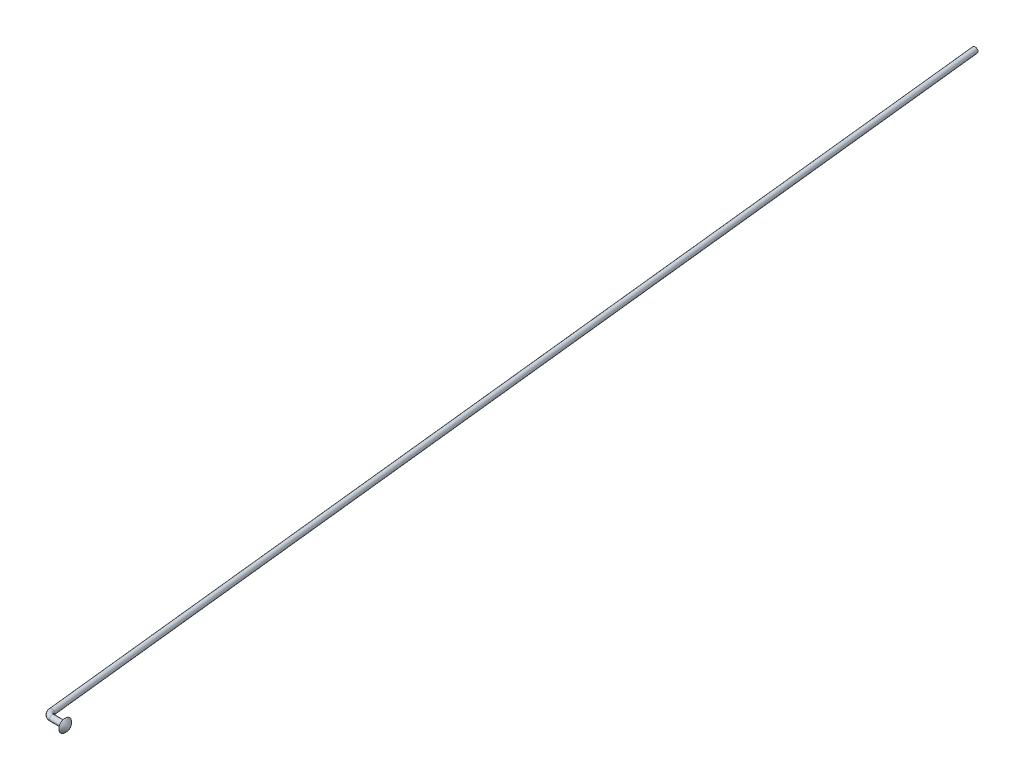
ISO-10303-21;
HEADER;
FILE_DESCRIPTION(('STEP AP214'),'2;1');
FILE_NAME('part.step','',(''),(''),'','','');
FILE_SCHEMA(('AUTOMOTIVE_DESIGN { 1 0 10303 214 1 1 1 1 }'));
ENDSEC;
DATA;
#1=APPLICATION_CONTEXT('core data for automotive mechanical design processes');
#2=APPLICATION_PROTOCOL_DEFINITION('international standard','automotive_design',2000,#1);
#3=PRODUCT_CONTEXT('',#1,'mechanical');
#4=PRODUCT('Part','Part','',(#3));
#5=PRODUCT_RELATED_PRODUCT_CATEGORY('part','',(#4));
#6=PRODUCT_DEFINITION_FORMATION('','',#4);
#7=PRODUCT_DEFINITION_CONTEXT('part definition',#1,'design');
#8=PRODUCT_DEFINITION('design','',#6,#7);
#9=PRODUCT_DEFINITION_SHAPE('','',#8);
#10=(LENGTH_UNIT() NAMED_UNIT(*) SI_UNIT(.MILLI.,.METRE.));
#11=(NAMED_UNIT(*) PLANE_ANGLE_UNIT() SI_UNIT($,.RADIAN.));
#12=(NAMED_UNIT(*) SI_UNIT($,.STERADIAN.) SOLID_ANGLE_UNIT());
#13=UNCERTAINTY_MEASURE_WITH_UNIT(LENGTH_MEASURE(1.E-05),#10,'distance_accuracy_value','');
#14=(GEOMETRIC_REPRESENTATION_CONTEXT(3) GLOBAL_UNCERTAINTY_ASSIGNED_CONTEXT((#13)) GLOBAL_UNIT_ASSIGNED_CONTEXT((#10,
#11,#12)) REPRESENTATION_CONTEXT('',''));
#15=CARTESIAN_POINT('',(0.,0.,0.));
#16=DIRECTION('',(0.,0.,1.));
#17=DIRECTION('',(1.,0.,0.));
#18=AXIS2_PLACEMENT_3D('',#15,#16,#17);
#19=CARTESIAN_POINT('',(-30.7000000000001,0.,0.));
#20=DIRECTION('',(0.107177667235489,0.,0.994239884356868));
#21=DIRECTION('',(0.994239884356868,0.,-0.107177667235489));
#22=AXIS2_PLACEMENT_3D('',#19,#20,#21);
#23=PLANE('',#22);
#24=CARTESIAN_POINT('',(-30.7000000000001,0.,0.));
#25=DIRECTION('',(0.107177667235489,0.,0.994239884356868));
#26=DIRECTION('',(0.994239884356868,0.,-0.107177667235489));
#27=AXIS2_PLACEMENT_3D('',#24,#25,#26);
#28=CIRCLE('',#27,0.749999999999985);
#29=CARTESIAN_POINT('',(-29.9543200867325,0.,-0.0803832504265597));
#30=VERTEX_POINT('',#29);
#31=EDGE_CURVE('E40',#30,#30,#28,.T.);
#32=ORIENTED_EDGE('',*,*,#31,.F.);
#33=EDGE_LOOP('',(#32));
#34=FACE_BOUND('',#33,.T.);
#35=ADVANCED_FACE('F33',(#34),#23,.F.);
#36=CARTESIAN_POINT('',(0.758258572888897,0.,277.829081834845));
#37=DIRECTION('',(0.,1.,0.));
#38=DIRECTION('',(0.,0.,1.));
#39=AXIS2_PLACEMENT_3D('',#36,#37,#38);
#40=TOROIDAL_SURFACE('',#39,1.5000000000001,0.749999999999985);
#41=CARTESIAN_POINT('',(0.758258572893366,0.,279.329081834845));
#42=DIRECTION('',(1.,0.,0.));
#43=DIRECTION('',(0.,0.,-1.));
#44=AXIS2_PLACEMENT_3D('',#41,#42,#43);
#45=CIRCLE('',#44,0.749999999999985);
#46=CARTESIAN_POINT('',(0.758258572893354,0.,278.579081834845));
#47=VERTEX_POINT('',#46);
#48=EDGE_CURVE('E95',#47,#47,#45,.T.);
#49=ORIENTED_EDGE('',*,*,#48,.F.);
#50=EDGE_LOOP('',(#49));
#51=FACE_BOUND('',#50,.T.);
#52=CARTESIAN_POINT('',(-0.733860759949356,0.,277.982639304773));
#53=DIRECTION('',(0.107177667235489,0.,0.994239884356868));
#54=DIRECTION('',(0.994239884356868,0.,-0.107177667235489));
#55=AXIS2_PLACEMENT_3D('',#52,#53,#54);
#56=CIRCLE('',#55,0.749999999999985);
#57=CARTESIAN_POINT('',(0.0118191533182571,0.,277.902256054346));
#58=VERTEX_POINT('',#57);
#59=EDGE_CURVE('E11',#58,#58,#56,.T.);
#60=ORIENTED_EDGE('',*,*,#59,.T.);
#61=EDGE_LOOP('',(#60));
#62=FACE_BOUND('',#61,.T.);
#63=ADVANCED_FACE('F62',(#51,#62),#40,.T.);
#64=CARTESIAN_POINT('',(0.758258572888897,0.,279.329081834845));
#65=DIRECTION('',(1.,0.,0.));
#66=DIRECTION('',(0.,0.,-1.));
#67=AXIS2_PLACEMENT_3D('',#64,#65,#66);
#68=CYLINDRICAL_SURFACE('',#67,0.749999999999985);
#69=CARTESIAN_POINT('',(4.22781762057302,0.,279.329081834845));
#70=DIRECTION('',(1.,0.,0.));
#71=DIRECTION('',(0.,0.,-1.));
#72=AXIS2_PLACEMENT_3D('',#69,#70,#71);
#73=CIRCLE('',#72,0.749999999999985);
#74=CARTESIAN_POINT('',(4.22781762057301,0.,278.579081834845));
#75=VERTEX_POINT('',#74);
#76=EDGE_CURVE('E97',#75,#75,#73,.T.);
#77=ORIENTED_EDGE('',*,*,#76,.F.);
#78=EDGE_LOOP('',(#77));
#79=FACE_BOUND('',#78,.T.);
#80=ORIENTED_EDGE('',*,*,#48,.T.);
#81=EDGE_LOOP('',(#80));
#82=FACE_BOUND('',#81,.T.);
#83=ADVANCED_FACE('F56',(#79,#82),#68,.T.);
#84=CARTESIAN_POINT('',(-30.7000000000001,0.,0.));
#85=DIRECTION('',(0.107177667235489,0.,0.994239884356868));
#86=DIRECTION('',(0.994239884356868,0.,-0.107177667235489));
#87=AXIS2_PLACEMENT_3D('',#84,#85,#86);
#88=CYLINDRICAL_SURFACE('',#87,0.749999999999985);
#89=CARTESIAN_POINT('',(0.0118191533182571,0.,277.902256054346));
#90=CARTESIAN_POINT('',(-0.300328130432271,0.,275.006603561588));
#91=CARTESIAN_POINT('',(-0.612475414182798,0.,272.11095106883));
#92=CARTESIAN_POINT('',(-1.23676998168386,0.,266.319646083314));
#93=CARTESIAN_POINT('',(-1.54891726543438,0.,263.423993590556));
#94=CARTESIAN_POINT('',(-2.17321183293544,0.,257.63268860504));
#95=CARTESIAN_POINT('',(-2.48535911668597,0.,254.737036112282));
#96=CARTESIAN_POINT('',(-3.10965368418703,0.,248.945731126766));
#97=CARTESIAN_POINT('',(-3.42180096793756,0.,246.050078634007));
#98=CARTESIAN_POINT('',(-4.04609553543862,0.,240.258773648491));
#99=CARTESIAN_POINT('',(-4.35824281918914,0.,237.363121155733));
#100=CARTESIAN_POINT('',(-4.9825373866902,0.,231.571816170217));
#101=CARTESIAN_POINT('',(-5.29468467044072,0.,228.676163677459));
#102=CARTESIAN_POINT('',(-5.91897923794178,0.,222.884858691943));
#103=CARTESIAN_POINT('',(-6.23112652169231,0.,219.989206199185));
#104=CARTESIAN_POINT('',(-6.85542108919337,0.,214.197901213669));
#105=CARTESIAN_POINT('',(-7.1675683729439,0.,211.302248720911));
#106=CARTESIAN_POINT('',(-7.79186294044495,0.,205.510943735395));
#107=CARTESIAN_POINT('',(-8.10401022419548,0.,202.615291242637));
#108=CARTESIAN_POINT('',(-8.72830479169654,0.,196.823986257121));
#109=CARTESIAN_POINT('',(-9.04045207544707,0.,193.928333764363));
#110=CARTESIAN_POINT('',(-9.66474664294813,0.,188.137028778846));
#111=CARTESIAN_POINT('',(-9.97689392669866,0.,185.241376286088));
#112=CARTESIAN_POINT('',(-10.6011884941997,0.,179.450071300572));
#113=CARTESIAN_POINT('',(-10.9133357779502,0.,176.554418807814));
#114=CARTESIAN_POINT('',(-11.5376303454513,0.,170.763113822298));
#115=CARTESIAN_POINT('',(-11.8497776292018,0.,167.86746132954));
#116=CARTESIAN_POINT('',(-12.4740721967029,0.,162.076156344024));
#117=CARTESIAN_POINT('',(-12.7862194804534,0.,159.180503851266));
#118=CARTESIAN_POINT('',(-13.4105140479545,0.,153.38919886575));
#119=CARTESIAN_POINT('',(-13.722661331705,0.,150.493546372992));
#120=CARTESIAN_POINT('',(-14.3469558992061,0.,144.702241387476));
#121=CARTESIAN_POINT('',(-14.6591031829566,0.,141.806588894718));
#122=CARTESIAN_POINT('',(-15.2833977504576,0.,136.015283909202));
#123=CARTESIAN_POINT('',(-15.5955450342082,0.,133.119631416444));
#124=CARTESIAN_POINT('',(-16.2198396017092,0.,127.328326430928));
#125=CARTESIAN_POINT('',(-16.5319868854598,0.,124.432673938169));
#126=CARTESIAN_POINT('',(-17.1562814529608,0.,118.641368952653));
#127=CARTESIAN_POINT('',(-17.4684287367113,0.,115.745716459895));
#128=CARTESIAN_POINT('',(-18.0927233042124,0.,109.954411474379));
#129=CARTESIAN_POINT('',(-18.4048705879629,0.,107.058758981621));
#130=CARTESIAN_POINT('',(-19.029165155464,0.,101.267453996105));
#131=CARTESIAN_POINT('',(-19.3413124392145,0.,98.3718015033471));
#132=CARTESIAN_POINT('',(-19.9656070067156,0.,92.580496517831));
#133=CARTESIAN_POINT('',(-20.2777542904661,0.,89.6848440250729));
#134=CARTESIAN_POINT('',(-20.9020488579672,0.,83.8935390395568));
#135=CARTESIAN_POINT('',(-21.2141961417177,0.,80.9978865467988));
#136=CARTESIAN_POINT('',(-21.8384907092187,0.,75.2065815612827));
#137=CARTESIAN_POINT('',(-22.1506379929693,0.,72.3109290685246));
#138=CARTESIAN_POINT('',(-22.7749325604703,0.,66.5196240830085));
#139=CARTESIAN_POINT('',(-23.0870798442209,0.,63.6239715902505));
#140=CARTESIAN_POINT('',(-23.7113744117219,0.,57.8326666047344));
#141=CARTESIAN_POINT('',(-24.0235216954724,0.,54.9370141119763));
#142=CARTESIAN_POINT('',(-24.6478162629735,0.,49.1457091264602));
#143=CARTESIAN_POINT('',(-24.959963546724,0.,46.2500566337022));
#144=CARTESIAN_POINT('',(-25.5842581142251,0.,40.4587516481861));
#145=CARTESIAN_POINT('',(-25.8964053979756,0.,37.5630991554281));
#146=CARTESIAN_POINT('',(-26.5206999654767,0.,31.771794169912));
#147=CARTESIAN_POINT('',(-26.8328472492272,0.,28.8761416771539));
#148=CARTESIAN_POINT('',(-27.4571418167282,0.,23.0848366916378));
#149=CARTESIAN_POINT('',(-27.7692891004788,0.,20.1891841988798));
#150=CARTESIAN_POINT('',(-28.3935836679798,0.,14.3978792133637));
#151=CARTESIAN_POINT('',(-28.7057309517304,0.,11.5022267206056));
#152=CARTESIAN_POINT('',(-29.3300255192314,0.,5.71092173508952));
#153=CARTESIAN_POINT('',(-29.642172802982,0.,2.81526924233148));
#154=CARTESIAN_POINT('',(-29.9543200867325,0.,-0.0803832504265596));
#155=B_SPLINE_CURVE_WITH_KNOTS('',3,(#89,#90,#91,#92,#93,#94,#95,#96,#97,#98,#99,#100,#101,#102,
#103,#104,#105,#106,#107,#108,#109,#110,#111,#112,#113,#114,#115,#116,#117,#118,#119,#120,#121,
#122,#123,#124,#125,#126,#127,#128,#129,#130,#131,#132,#133,#134,#135,#136,#137,#138,#139,#140,
#141,#142,#143,#144,#145,#146,#147,#148,#149,#150,#151,#152,#153,#154),.UNSPECIFIED.,.F.,.F.,(4,
2,2,2,2,2,2,2,2,2,2,2,2,2,2,2,2,2,2,2,2,2,2,2,2,2,2,2,2,2,2,2,4),(0.,8.73728525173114,
17.4745705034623,26.2118557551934,34.9491410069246,43.6864262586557,52.4237115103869,
61.160996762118,69.8982820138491,78.6355672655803,87.3728525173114,96.1101377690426,
104.847423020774,113.584708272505,122.321993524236,131.059278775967,139.796564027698,
148.533849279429,157.271134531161,166.008419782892,174.745705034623,183.482990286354,
192.220275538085,200.957560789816,209.694846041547,218.432131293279,227.16941654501,
235.906701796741,244.643987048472,253.381272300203,262.118557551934,270.855842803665,
279.593128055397),.UNSPECIFIED.);
#156=EDGE_CURVE('BSEAM51',#58,#30,#155,.T.);
#157=ORIENTED_EDGE('',*,*,#59,.F.);
#158=ORIENTED_EDGE('',*,*,#31,.T.);
#159=ORIENTED_EDGE('',*,*,#156,.T.);
#160=ORIENTED_EDGE('',*,*,#156,.F.);
#161=EDGE_LOOP('',(#157,#159,#158,#160));
#162=FACE_BOUND('',#161,.T.);
#163=ADVANCED_FACE('F51',(#162),#88,.T.);
#164=CARTESIAN_POINT('',(4.22781762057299,0.,279.329081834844));
#165=DIRECTION('',(-1.,0.,0.));
#166=DIRECTION('',(0.,0.,1.));
#167=AXIS2_PLACEMENT_3D('',#164,#165,#166);
#168=PLANE('',#167);
#169=ORIENTED_EDGE('',*,*,#76,.T.);
#170=EDGE_LOOP('',(#169));
#171=FACE_BOUND('',#170,.T.);
#172=CARTESIAN_POINT('',(4.22781762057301,0.,279.329081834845));
#173=DIRECTION('',(1.,0.,0.));
#174=DIRECTION('',(0.,0.,-1.));
#175=AXIS2_PLACEMENT_3D('',#172,#173,#174);
#176=CIRCLE('',#175,1.70000000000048);
#177=CARTESIAN_POINT('',(4.22781762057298,0.,277.629081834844));
#178=VERTEX_POINT('',#177);
#179=EDGE_CURVE('E98',#178,#178,#176,.T.);
#180=ORIENTED_EDGE('',*,*,#179,.F.);
#181=EDGE_LOOP('',(#180));
#182=FACE_BOUND('',#181,.T.);
#183=ADVANCED_FACE('F45',(#171,#182),#168,.T.);
#184=CARTESIAN_POINT('',(2.28571292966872,0.,279.915614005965));
#185=DIRECTION('',(0.,-1.,0.));
#186=DIRECTION('',(0.,0.,-1.));
#187=AXIS2_PLACEMENT_3D('',#184,#185,#186);
#188=CIRCLE('',#187,3.00000000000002);
#189=TRIMMED_CURVE('',#188,(PARAMETER_VALUE(-1.37401812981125)),
(PARAMETER_VALUE(1.37401812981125)),.T.,.PARAMETER.);
#190=CARTESIAN_POINT('',(2.28571292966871,0.,279.329081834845));
#191=DIRECTION('',(1.,0.,0.));
#192=AXIS1_PLACEMENT('',#190,#191);
#193=SURFACE_OF_REVOLUTION('',#189,#192);
#194=ORIENTED_EDGE('',*,*,#179,.T.);
#195=EDGE_LOOP('',(#194));
#196=FACE_BOUND('',#195,.T.);
#197=CARTESIAN_POINT('',(5.22781762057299,0.,279.329081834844));
#198=VERTEX_POINT('',#197);
#199=VERTEX_LOOP('',#198);
#200=FACE_BOUND('',#199,.T.);
#201=ADVANCED_FACE('F43',(#196,#200),#193,.T.);
#202=CLOSED_SHELL('',(#35,#63,#83,#163,#183,#201));
#203=MANIFOLD_SOLID_BREP('B2',#202);
#204=ADVANCED_BREP_SHAPE_REPRESENTATION('',(#18,#203),#14);
#205=SHAPE_DEFINITION_REPRESENTATION(#9,#204);
ENDSEC;
END-ISO-10303-21;
